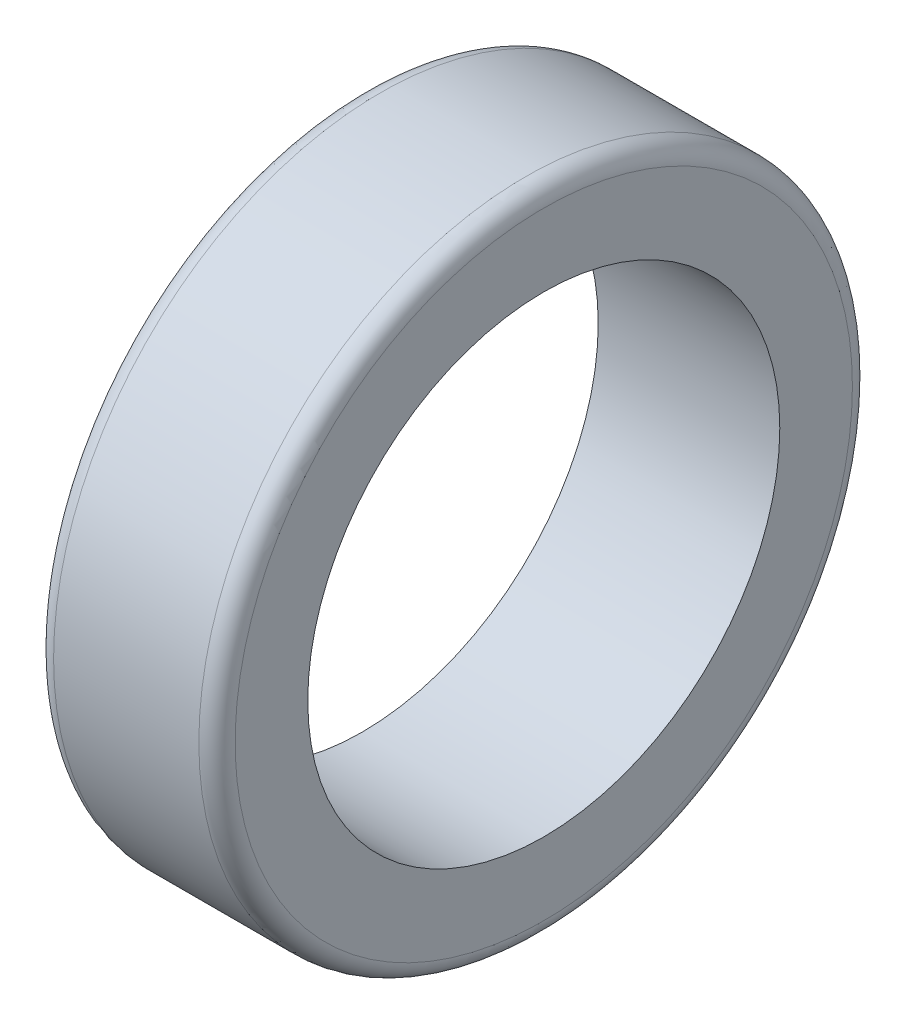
from build123d import *

# Parameters (mm, degrees)
SKETCH2_R      = 65
EXTRUDE1_DEPTH = 170.779268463


with BuildPart() as part:
    # Sketch1 → Revolve1 (revolve)
    with BuildSketch(Plane.XY, mode=Mode.PRIVATE) as revolve1_sk:
        with BuildLine():
            Line((25, -45), (-25, -45))
            Line((-25, -45), (-25, 40))
            ThreePointArc((-25, 40), (-23.535533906, 43.535533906), (-20, 45))
            Line((-20, 45), (20, 45))
            ThreePointArc((20, 45), (23.535533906, 43.535533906), (25, 40))
            Line((25, 40), (25, -45))
        make_face()
    revolve(revolve1_sk.sketch.rotate(Axis((25, -45, 0), (-1, 0, 0)), 90), axis=Axis((25, -45, 0), (-1, 0, 0)))

    # Sketch2 → Extrude1 (cut, through all)
    with BuildSketch(Plane(origin=(25, 0, 0), x_dir=(0, 0, -1), z_dir=(1, 0, 0))):
        with Locations((0, -45)):
            Circle(SKETCH2_R)
    extrude(amount=-EXTRUDE1_DEPTH, mode=Mode.SUBTRACT)


solid = part.part
